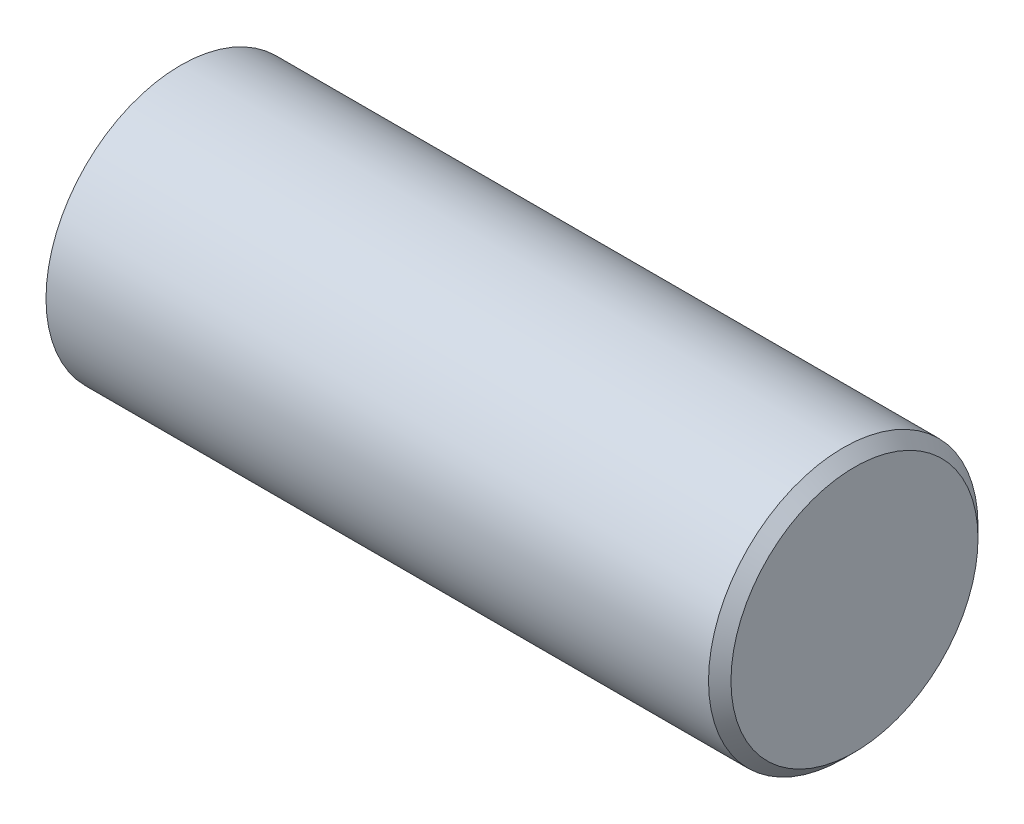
from build123d import *

# Parameters (mm, degrees)
CHANFREIN1_SIZE = 0.5


with BuildPart() as part:
    # Esquisse1 → R_volution1 (revolve)
    with BuildSketch(Plane.XY):
        with BuildLine():
            Line((0, 0), (32, 0))
            Line((32, 0), (32, 6))
            Line((32, 6), (2, 6))
            ThreePointArc((2, 6), (0.513167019, 3.16227766), (0, 0))
        make_face()
    revolve(axis=Axis((0, 0, 0), (1, 0, 0)))

    # Chanfrein1
    chanfrein1_edges = [part.edges().sort_by_distance(p)[0] for p in [
        (32, -6, 0),
    ]]
    chamfer(chanfrein1_edges, length=CHANFREIN1_SIZE)


solid = part.part
